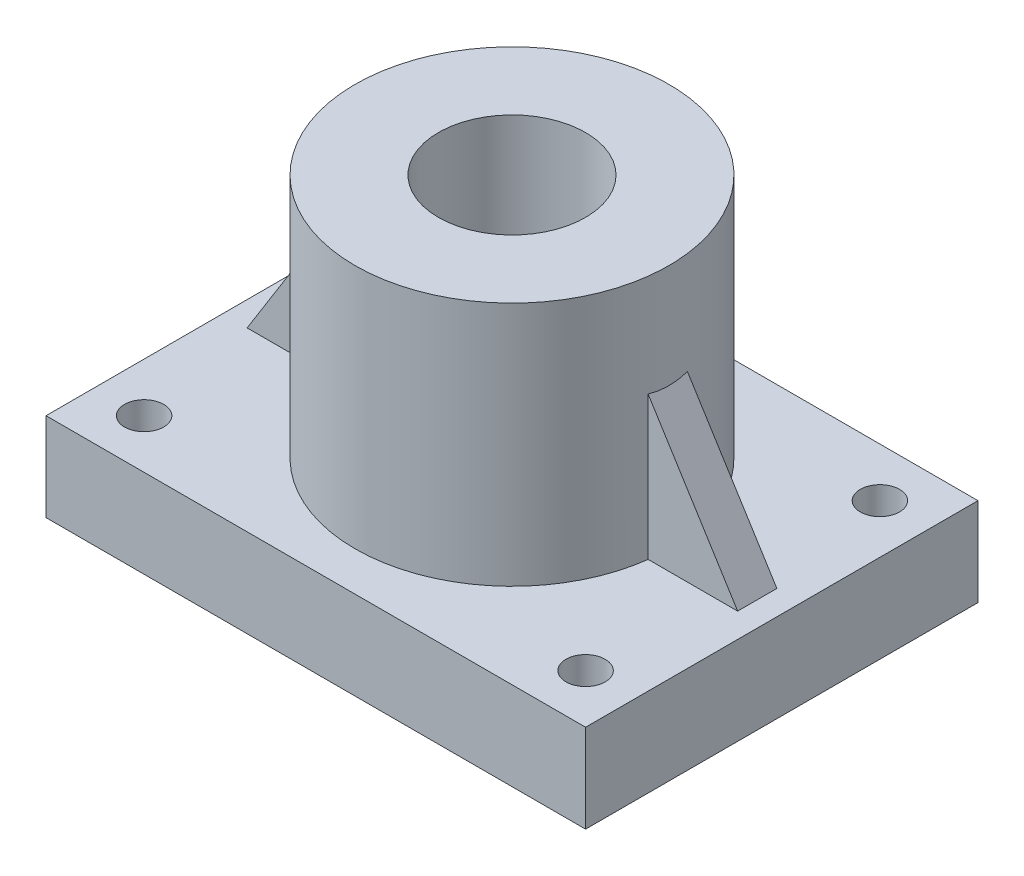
from build123d import *

# Parameters (mm, degrees)
SKETCH_1_W          = 110
SKETCH_1_H          = 80
EXTRUDE_1_DEPTH     = 18
SKETCH_2_R          = 32
EXTRUDE_2_DEPTH     = 50
SKETCH_3_R          = 15
CUT_EXTRUDE_1_DEPTH = 75
EXTRUDE_3_DEPTH     = 4
EXTRUDE_4_DEPTH     = 4
SKETCH_7_R          = 4
CUT_EXTRUDE_3_DEPTH = 25
SKETCH_8_R          = 4
CUT_EXTRUDE_4_DEPTH = 25
SKETCH_9_R          = 4
CUT_EXTRUDE_5_DEPTH = 25
SKETCH_10_R         = 4
CUT_EXTRUDE_6_DEPTH = 25


with BuildPart() as part:
    # Sketch 1 → Extrude 1 (new body)
    with BuildSketch(Plane(origin=(0, 0, 0), x_dir=(1, 0, 0), z_dir=(0, 1, 0))):
        Rectangle(SKETCH_1_W, SKETCH_1_H)
    extrude(amount=EXTRUDE_1_DEPTH)

    # Sketch 2 → Extrude 2 (add)
    with BuildSketch(Plane(origin=(0, 18, 0), x_dir=(1, 0, 0), z_dir=(0, 1, 0))):
        with Locations(Location((0, 0, 0), (0, 0, 270))):
            Circle(SKETCH_2_R)
    extrude(amount=EXTRUDE_2_DEPTH)

    # Sketch 3 → Cut-Extrude 1 (cut)
    with BuildSketch(Plane(origin=(0, 0, 0), x_dir=(1, 0, 0), z_dir=(0, 1, 0))):
        with Locations(Location((0, 0, 0), (0, 0, 270))):
            Circle(SKETCH_3_R)
    extrude(amount=CUT_EXTRUDE_1_DEPTH, mode=Mode.SUBTRACT)

    # Sketch 4 → Extrude 3 (add, symmetric)
    with BuildSketch(Plane.XY):
        Polygon((25, 18), (50, 18), (25, 58), align=None)
    extrude(amount=EXTRUDE_3_DEPTH, both=True)

    # Sketch 5 → Extrude 4 (add, symmetric)
    with BuildSketch(Plane.XY):
        Polygon((-25, 18), (-50, 18), (-25, 58), align=None)
    extrude(amount=EXTRUDE_4_DEPTH, both=True)

    # Sketch 7 → Cut-Extrude 3 (cut)
    with BuildSketch(Plane(origin=(0, 0, 0), x_dir=(1, 0, 0), z_dir=(0, 1, 0))):
        with Locations(Location((45, 30, 0), (0, 0, 90))):
            Circle(SKETCH_7_R)
    extrude(amount=CUT_EXTRUDE_3_DEPTH, mode=Mode.SUBTRACT)

    # Sketch 8 → Cut-Extrude 4 (cut)
    with BuildSketch(Plane(origin=(0, 0, 0), x_dir=(1, 0, 0), z_dir=(0, 1, 0))):
        with Locations(Location((-45, 30, 0), (0, 0, 90))):
            Circle(SKETCH_8_R)
    extrude(amount=CUT_EXTRUDE_4_DEPTH, mode=Mode.SUBTRACT)

    # Sketch 9 → Cut-Extrude 5 (cut)
    with BuildSketch(Plane(origin=(0, 0, 0), x_dir=(1, 0, 0), z_dir=(0, 1, 0))):
        with Locations(Location((45, -30, 0), (0, 0, 90))):
            Circle(SKETCH_9_R)
    extrude(amount=CUT_EXTRUDE_5_DEPTH, mode=Mode.SUBTRACT)

    # Sketch 10 → Cut-Extrude 6 (cut)
    with BuildSketch(Plane(origin=(0, 0, 0), x_dir=(1, 0, 0), z_dir=(0, 1, 0))):
        with Locations(Location((-45, -30, 0), (0, 0, 90))):
            Circle(SKETCH_10_R)
    extrude(amount=CUT_EXTRUDE_6_DEPTH, mode=Mode.SUBTRACT)


solid = part.part
